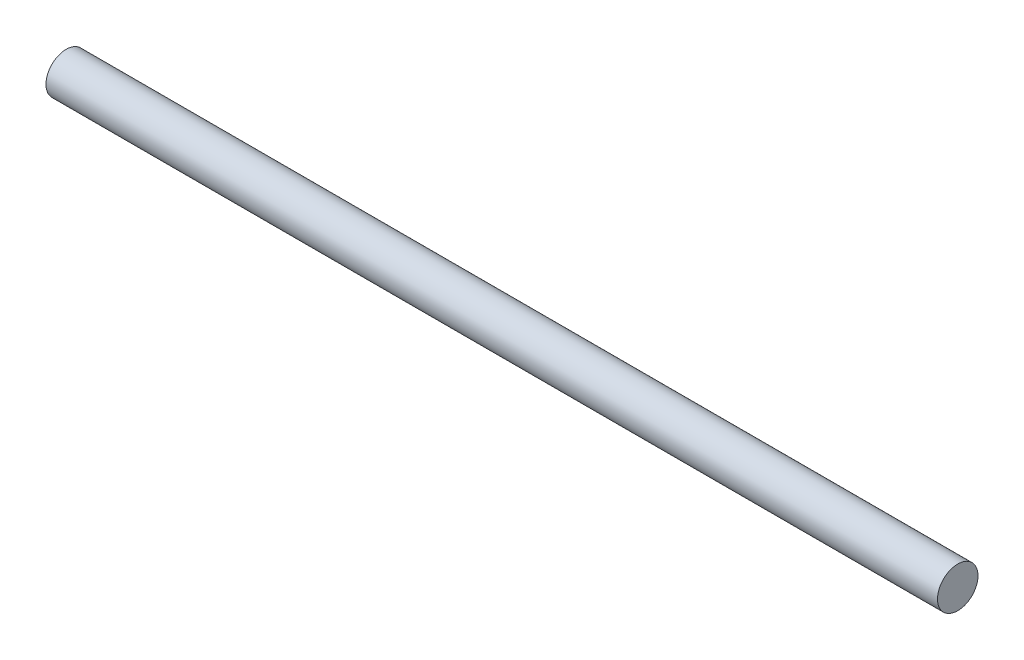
from build123d import *

# Parameters (mm, degrees)
SKETCH1_R           = 5
BOSS_EXTRUDE1_DEPTH = 220


with BuildPart() as part:
    # Sketch1 → Boss-Extrude1 (new body)
    with BuildSketch(Plane(origin=(0, 0, 0), x_dir=(0, 0, -1), z_dir=(1, 0, 0))):
        Circle(SKETCH1_R)
    extrude(amount=BOSS_EXTRUDE1_DEPTH)


solid = part.part
